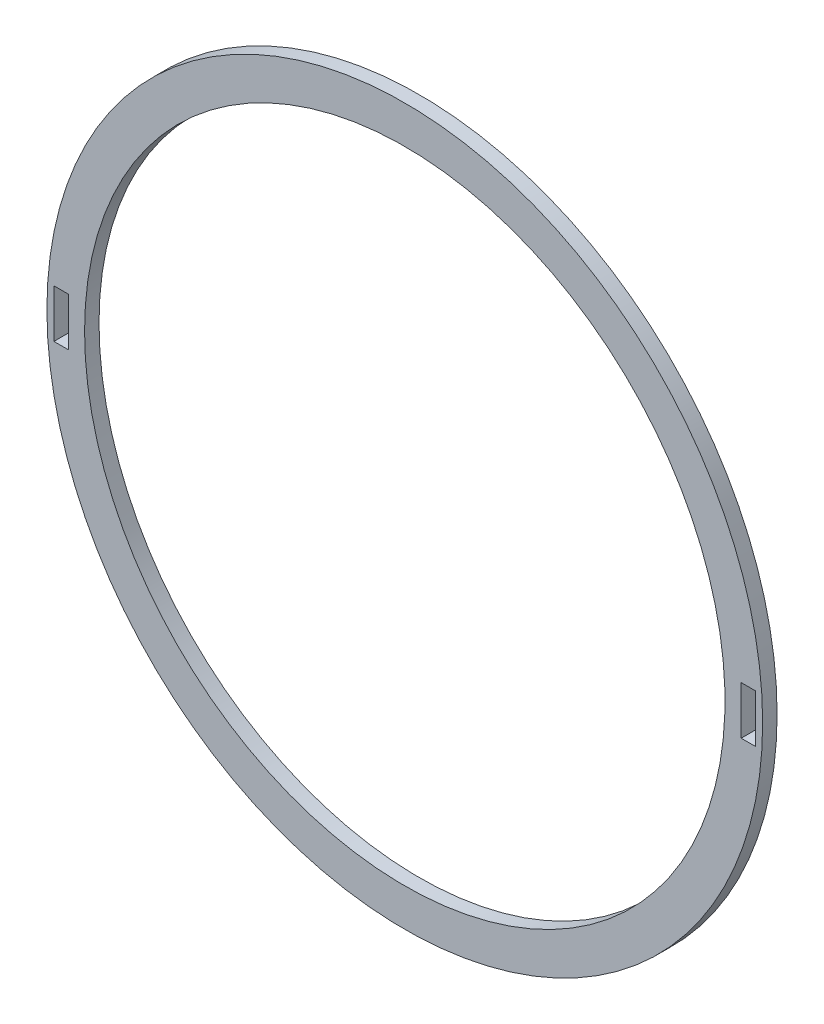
ISO-10303-21;
HEADER;
FILE_DESCRIPTION(('STEP AP214'),'2;1');
FILE_NAME('part.step','',(''),(''),'','','');
FILE_SCHEMA(('AUTOMOTIVE_DESIGN { 1 0 10303 214 1 1 1 1 }'));
ENDSEC;
DATA;
#1=APPLICATION_CONTEXT('core data for automotive mechanical design processes');
#2=APPLICATION_PROTOCOL_DEFINITION('international standard','automotive_design',2000,#1);
#3=PRODUCT_CONTEXT('',#1,'mechanical');
#4=PRODUCT('Part','Part','',(#3));
#5=PRODUCT_RELATED_PRODUCT_CATEGORY('part','',(#4));
#6=PRODUCT_DEFINITION_FORMATION('','',#4);
#7=PRODUCT_DEFINITION_CONTEXT('part definition',#1,'design');
#8=PRODUCT_DEFINITION('design','',#6,#7);
#9=PRODUCT_DEFINITION_SHAPE('','',#8);
#10=(LENGTH_UNIT() NAMED_UNIT(*) SI_UNIT(.MILLI.,.METRE.));
#11=(NAMED_UNIT(*) PLANE_ANGLE_UNIT() SI_UNIT($,.RADIAN.));
#12=(NAMED_UNIT(*) SI_UNIT($,.STERADIAN.) SOLID_ANGLE_UNIT());
#13=UNCERTAINTY_MEASURE_WITH_UNIT(LENGTH_MEASURE(1.E-05),#10,'distance_accuracy_value','');
#14=(GEOMETRIC_REPRESENTATION_CONTEXT(3) GLOBAL_UNCERTAINTY_ASSIGNED_CONTEXT((#13)) GLOBAL_UNIT_ASSIGNED_CONTEXT((#10,
#11,#12)) REPRESENTATION_CONTEXT('',''));
#15=CARTESIAN_POINT('',(0.,0.,0.));
#16=DIRECTION('',(0.,0.,1.));
#17=DIRECTION('',(1.,0.,0.));
#18=AXIS2_PLACEMENT_3D('',#15,#16,#17);
#19=CARTESIAN_POINT('',(0.,25.141193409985,1.524));
#20=DIRECTION('',(0.,0.,1.));
#21=DIRECTION('',(1.,0.,0.));
#22=AXIS2_PLACEMENT_3D('',#19,#20,#21);
#23=PLANE('',#22);
#24=CARTESIAN_POINT('',(0.,25.141193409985,1.524));
#25=DIRECTION('',(0.,0.,1.));
#26=DIRECTION('',(1.,0.,0.));
#27=AXIS2_PLACEMENT_3D('',#24,#25,#26);
#28=CIRCLE('',#27,33.7768673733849);
#29=CARTESIAN_POINT('',(-33.7768673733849,25.141193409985,1.524));
#30=VERTEX_POINT('',#29);
#31=EDGE_CURVE('E135',#30,#30,#28,.T.);
#32=ORIENTED_EDGE('',*,*,#31,.F.);
#33=EDGE_LOOP('',(#32));
#34=FACE_BOUND('',#33,.T.);
#35=CARTESIAN_POINT('',(0.,25.141193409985,1.524));
#36=DIRECTION('',(0.,0.,1.));
#37=DIRECTION('',(1.,0.,0.));
#38=AXIS2_PLACEMENT_3D('',#35,#36,#37);
#39=CIRCLE('',#38,37.7498927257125);
#40=CARTESIAN_POINT('',(-37.7498927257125,25.141193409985,1.524));
#41=VERTEX_POINT('',#40);
#42=EDGE_CURVE('E11',#41,#41,#39,.T.);
#43=ORIENTED_EDGE('',*,*,#42,.T.);
#44=EDGE_LOOP('',(#43));
#45=FACE_BOUND('',#44,.T.);
#46=DIRECTION('',(-1.,0.,0.));
#47=VECTOR('',#46,1.);
#48=CARTESIAN_POINT('',(37.0095439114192,27.681193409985,1.524));
#49=LINE('',#48,#47);
#50=CARTESIAN_POINT('',(37.0095439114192,27.681193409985,1.524));
#51=VERTEX_POINT('',#50);
#52=CARTESIAN_POINT('',(35.4855439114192,27.681193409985,1.524));
#53=VERTEX_POINT('',#52);
#54=EDGE_CURVE('E143',#51,#53,#49,.T.);
#55=ORIENTED_EDGE('',*,*,#54,.F.);
#56=DIRECTION('',(0.,1.,0.));
#57=VECTOR('',#56,1.);
#58=CARTESIAN_POINT('',(37.0095439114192,27.681193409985,1.524));
#59=LINE('',#58,#57);
#60=CARTESIAN_POINT('',(37.0095439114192,22.601193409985,1.524));
#61=VERTEX_POINT('',#60);
#62=EDGE_CURVE('E141',#61,#51,#59,.T.);
#63=ORIENTED_EDGE('',*,*,#62,.F.);
#64=DIRECTION('',(1.,0.,0.));
#65=VECTOR('',#64,1.);
#66=CARTESIAN_POINT('',(37.0095439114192,22.601193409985,1.524));
#67=LINE('',#66,#65);
#68=CARTESIAN_POINT('',(35.4855439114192,22.601193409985,1.524));
#69=VERTEX_POINT('',#68);
#70=EDGE_CURVE('E149',#69,#61,#67,.T.);
#71=ORIENTED_EDGE('',*,*,#70,.F.);
#72=DIRECTION('',(0.,-1.,0.));
#73=VECTOR('',#72,1.);
#74=CARTESIAN_POINT('',(35.4855439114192,27.681193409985,1.524));
#75=LINE('',#74,#73);
#76=EDGE_CURVE('E146',#53,#69,#75,.T.);
#77=ORIENTED_EDGE('',*,*,#76,.F.);
#78=EDGE_LOOP('',(#55,#63,#71,#77));
#79=FACE_BOUND('',#78,.T.);
#80=DIRECTION('',(0.,-1.,0.));
#81=VECTOR('',#80,1.);
#82=CARTESIAN_POINT('',(-37.0095439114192,27.681193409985,1.524));
#83=LINE('',#82,#81);
#84=CARTESIAN_POINT('',(-37.0095439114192,27.681193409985,1.524));
#85=VERTEX_POINT('',#84);
#86=CARTESIAN_POINT('',(-37.0095439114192,22.601193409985,1.524));
#87=VERTEX_POINT('',#86);
#88=EDGE_CURVE('E107',#85,#87,#83,.T.);
#89=ORIENTED_EDGE('',*,*,#88,.F.);
#90=DIRECTION('',(-1.,0.,0.));
#91=VECTOR('',#90,1.);
#92=CARTESIAN_POINT('',(-37.0095439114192,27.681193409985,1.524));
#93=LINE('',#92,#91);
#94=CARTESIAN_POINT('',(-35.4855439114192,27.681193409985,1.524));
#95=VERTEX_POINT('',#94);
#96=EDGE_CURVE('E99',#95,#85,#93,.T.);
#97=ORIENTED_EDGE('',*,*,#96,.F.);
#98=DIRECTION('',(0.,1.,0.));
#99=VECTOR('',#98,1.);
#100=CARTESIAN_POINT('',(-35.4855439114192,27.681193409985,1.524));
#101=LINE('',#100,#99);
#102=CARTESIAN_POINT('',(-35.4855439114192,22.601193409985,1.524));
#103=VERTEX_POINT('',#102);
#104=EDGE_CURVE('E121',#103,#95,#101,.T.);
#105=ORIENTED_EDGE('',*,*,#104,.F.);
#106=DIRECTION('',(1.,0.,0.));
#107=VECTOR('',#106,1.);
#108=CARTESIAN_POINT('',(-37.0095439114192,22.601193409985,1.524));
#109=LINE('',#108,#107);
#110=EDGE_CURVE('E119',#87,#103,#109,.T.);
#111=ORIENTED_EDGE('',*,*,#110,.F.);
#112=EDGE_LOOP('',(#89,#97,#105,#111));
#113=FACE_BOUND('',#112,.T.);
#114=ADVANCED_FACE('F34',(#34,#45,#79,#113),#23,.T.);
#115=CARTESIAN_POINT('',(0.,25.141193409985,0.));
#116=DIRECTION('',(0.,0.,1.));
#117=DIRECTION('',(1.,0.,0.));
#118=AXIS2_PLACEMENT_3D('',#115,#116,#117);
#119=PLANE('',#118);
#120=CARTESIAN_POINT('',(0.,25.141193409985,0.));
#121=DIRECTION('',(0.,0.,1.));
#122=DIRECTION('',(1.,0.,0.));
#123=AXIS2_PLACEMENT_3D('',#120,#121,#122);
#124=CIRCLE('',#123,33.7768673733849);
#125=CARTESIAN_POINT('',(-33.7768673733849,25.141193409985,0.));
#126=VERTEX_POINT('',#125);
#127=EDGE_CURVE('E115',#126,#126,#124,.T.);
#128=ORIENTED_EDGE('',*,*,#127,.T.);
#129=EDGE_LOOP('',(#128));
#130=FACE_BOUND('',#129,.T.);
#131=CARTESIAN_POINT('',(0.,25.141193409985,0.));
#132=DIRECTION('',(0.,0.,1.));
#133=DIRECTION('',(1.,0.,0.));
#134=AXIS2_PLACEMENT_3D('',#131,#132,#133);
#135=CIRCLE('',#134,37.7498927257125);
#136=CARTESIAN_POINT('',(-37.7498927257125,25.141193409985,0.));
#137=VERTEX_POINT('',#136);
#138=EDGE_CURVE('E38',#137,#137,#135,.T.);
#139=ORIENTED_EDGE('',*,*,#138,.F.);
#140=EDGE_LOOP('',(#139));
#141=FACE_BOUND('',#140,.T.);
#142=DIRECTION('',(0.,1.,0.));
#143=VECTOR('',#142,1.);
#144=CARTESIAN_POINT('',(37.0095439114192,27.681193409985,0.));
#145=LINE('',#144,#143);
#146=CARTESIAN_POINT('',(37.0095439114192,22.601193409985,0.));
#147=VERTEX_POINT('',#146);
#148=CARTESIAN_POINT('',(37.0095439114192,27.681193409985,0.));
#149=VERTEX_POINT('',#148);
#150=EDGE_CURVE('E138',#147,#149,#145,.T.);
#151=ORIENTED_EDGE('',*,*,#150,.T.);
#152=DIRECTION('',(-1.,0.,0.));
#153=VECTOR('',#152,1.);
#154=CARTESIAN_POINT('',(37.0095439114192,27.681193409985,0.));
#155=LINE('',#154,#153);
#156=CARTESIAN_POINT('',(35.4855439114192,27.681193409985,0.));
#157=VERTEX_POINT('',#156);
#158=EDGE_CURVE('E154',#149,#157,#155,.T.);
#159=ORIENTED_EDGE('',*,*,#158,.T.);
#160=DIRECTION('',(0.,-1.,0.));
#161=VECTOR('',#160,1.);
#162=CARTESIAN_POINT('',(35.4855439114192,27.681193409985,0.));
#163=LINE('',#162,#161);
#164=CARTESIAN_POINT('',(35.4855439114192,22.601193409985,0.));
#165=VERTEX_POINT('',#164);
#166=EDGE_CURVE('E157',#157,#165,#163,.T.);
#167=ORIENTED_EDGE('',*,*,#166,.T.);
#168=DIRECTION('',(1.,0.,0.));
#169=VECTOR('',#168,1.);
#170=CARTESIAN_POINT('',(37.0095439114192,22.601193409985,0.));
#171=LINE('',#170,#169);
#172=EDGE_CURVE('E144',#165,#147,#171,.T.);
#173=ORIENTED_EDGE('',*,*,#172,.T.);
#174=EDGE_LOOP('',(#151,#159,#167,#173));
#175=FACE_BOUND('',#174,.T.);
#176=DIRECTION('',(-1.,0.,0.));
#177=VECTOR('',#176,1.);
#178=CARTESIAN_POINT('',(-37.0095439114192,27.681193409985,0.));
#179=LINE('',#178,#177);
#180=CARTESIAN_POINT('',(-35.4855439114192,27.681193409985,0.));
#181=VERTEX_POINT('',#180);
#182=CARTESIAN_POINT('',(-37.0095439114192,27.681193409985,0.));
#183=VERTEX_POINT('',#182);
#184=EDGE_CURVE('E57',#181,#183,#179,.T.);
#185=ORIENTED_EDGE('',*,*,#184,.T.);
#186=DIRECTION('',(0.,-1.,0.));
#187=VECTOR('',#186,1.);
#188=CARTESIAN_POINT('',(-37.0095439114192,27.681193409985,0.));
#189=LINE('',#188,#187);
#190=CARTESIAN_POINT('',(-37.0095439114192,22.601193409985,0.));
#191=VERTEX_POINT('',#190);
#192=EDGE_CURVE('E114',#183,#191,#189,.T.);
#193=ORIENTED_EDGE('',*,*,#192,.T.);
#194=DIRECTION('',(1.,0.,0.));
#195=VECTOR('',#194,1.);
#196=CARTESIAN_POINT('',(-37.0095439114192,22.601193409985,0.));
#197=LINE('',#196,#195);
#198=CARTESIAN_POINT('',(-35.4855439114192,22.601193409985,0.));
#199=VERTEX_POINT('',#198);
#200=EDGE_CURVE('E127',#191,#199,#197,.T.);
#201=ORIENTED_EDGE('',*,*,#200,.T.);
#202=DIRECTION('',(0.,1.,0.));
#203=VECTOR('',#202,1.);
#204=CARTESIAN_POINT('',(-35.4855439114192,27.681193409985,0.));
#205=LINE('',#204,#203);
#206=EDGE_CURVE('E108',#199,#181,#205,.T.);
#207=ORIENTED_EDGE('',*,*,#206,.T.);
#208=EDGE_LOOP('',(#185,#193,#201,#207));
#209=FACE_BOUND('',#208,.T.);
#210=ADVANCED_FACE('F176',(#130,#141,#175,#209),#119,.F.);
#211=CARTESIAN_POINT('',(0.,25.141193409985,1.524));
#212=DIRECTION('',(0.,0.,-1.));
#213=DIRECTION('',(-1.,0.,0.));
#214=AXIS2_PLACEMENT_3D('',#211,#212,#213);
#215=CYLINDRICAL_SURFACE('',#214,37.7498927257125);
#216=CARTESIAN_POINT('',(-37.7498927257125,25.141193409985,1.524));
#217=CARTESIAN_POINT('',(-37.7498927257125,25.141193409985,1.508125));
#218=CARTESIAN_POINT('',(-37.7498927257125,25.141193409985,1.49225));
#219=CARTESIAN_POINT('',(-37.7498927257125,25.141193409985,1.4605));
#220=CARTESIAN_POINT('',(-37.7498927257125,25.141193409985,1.444625));
#221=CARTESIAN_POINT('',(-37.7498927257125,25.141193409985,1.412875));
#222=CARTESIAN_POINT('',(-37.7498927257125,25.141193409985,1.397));
#223=CARTESIAN_POINT('',(-37.7498927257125,25.141193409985,1.36525));
#224=CARTESIAN_POINT('',(-37.7498927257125,25.141193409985,1.349375));
#225=CARTESIAN_POINT('',(-37.7498927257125,25.141193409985,1.317625));
#226=CARTESIAN_POINT('',(-37.7498927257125,25.141193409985,1.30175));
#227=CARTESIAN_POINT('',(-37.7498927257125,25.141193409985,1.27));
#228=CARTESIAN_POINT('',(-37.7498927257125,25.141193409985,1.254125));
#229=CARTESIAN_POINT('',(-37.7498927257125,25.141193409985,1.222375));
#230=CARTESIAN_POINT('',(-37.7498927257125,25.141193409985,1.2065));
#231=CARTESIAN_POINT('',(-37.7498927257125,25.141193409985,1.17475));
#232=CARTESIAN_POINT('',(-37.7498927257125,25.141193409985,1.158875));
#233=CARTESIAN_POINT('',(-37.7498927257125,25.141193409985,1.127125));
#234=CARTESIAN_POINT('',(-37.7498927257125,25.141193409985,1.11125));
#235=CARTESIAN_POINT('',(-37.7498927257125,25.141193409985,1.0795));
#236=CARTESIAN_POINT('',(-37.7498927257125,25.141193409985,1.063625));
#237=CARTESIAN_POINT('',(-37.7498927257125,25.141193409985,1.031875));
#238=CARTESIAN_POINT('',(-37.7498927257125,25.141193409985,1.016));
#239=CARTESIAN_POINT('',(-37.7498927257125,25.141193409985,0.98425));
#240=CARTESIAN_POINT('',(-37.7498927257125,25.141193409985,0.968375));
#241=CARTESIAN_POINT('',(-37.7498927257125,25.141193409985,0.936625));
#242=CARTESIAN_POINT('',(-37.7498927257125,25.141193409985,0.92075));
#243=CARTESIAN_POINT('',(-37.7498927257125,25.141193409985,0.889));
#244=CARTESIAN_POINT('',(-37.7498927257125,25.141193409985,0.873125));
#245=CARTESIAN_POINT('',(-37.7498927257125,25.141193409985,0.841375));
#246=CARTESIAN_POINT('',(-37.7498927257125,25.141193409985,0.8255));
#247=CARTESIAN_POINT('',(-37.7498927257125,25.141193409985,0.79375));
#248=CARTESIAN_POINT('',(-37.7498927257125,25.141193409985,0.777875));
#249=CARTESIAN_POINT('',(-37.7498927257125,25.141193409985,0.746125));
#250=CARTESIAN_POINT('',(-37.7498927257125,25.141193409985,0.73025));
#251=CARTESIAN_POINT('',(-37.7498927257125,25.141193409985,0.6985));
#252=CARTESIAN_POINT('',(-37.7498927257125,25.141193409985,0.682625));
#253=CARTESIAN_POINT('',(-37.7498927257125,25.141193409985,0.650875));
#254=CARTESIAN_POINT('',(-37.7498927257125,25.141193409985,0.635));
#255=CARTESIAN_POINT('',(-37.7498927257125,25.141193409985,0.60325));
#256=CARTESIAN_POINT('',(-37.7498927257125,25.141193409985,0.587375));
#257=CARTESIAN_POINT('',(-37.7498927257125,25.141193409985,0.555625));
#258=CARTESIAN_POINT('',(-37.7498927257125,25.141193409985,0.53975));
#259=CARTESIAN_POINT('',(-37.7498927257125,25.141193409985,0.508));
#260=CARTESIAN_POINT('',(-37.7498927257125,25.141193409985,0.492125));
#261=CARTESIAN_POINT('',(-37.7498927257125,25.141193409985,0.460375));
#262=CARTESIAN_POINT('',(-37.7498927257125,25.141193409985,0.4445));
#263=CARTESIAN_POINT('',(-37.7498927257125,25.141193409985,0.41275));
#264=CARTESIAN_POINT('',(-37.7498927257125,25.141193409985,0.396875));
#265=CARTESIAN_POINT('',(-37.7498927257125,25.141193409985,0.365125));
#266=CARTESIAN_POINT('',(-37.7498927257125,25.141193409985,0.34925));
#267=CARTESIAN_POINT('',(-37.7498927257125,25.141193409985,0.3175));
#268=CARTESIAN_POINT('',(-37.7498927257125,25.141193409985,0.301625));
#269=CARTESIAN_POINT('',(-37.7498927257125,25.141193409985,0.269875));
#270=CARTESIAN_POINT('',(-37.7498927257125,25.141193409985,0.254));
#271=CARTESIAN_POINT('',(-37.7498927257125,25.141193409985,0.22225));
#272=CARTESIAN_POINT('',(-37.7498927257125,25.141193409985,0.206375));
#273=CARTESIAN_POINT('',(-37.7498927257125,25.141193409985,0.174625));
#274=CARTESIAN_POINT('',(-37.7498927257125,25.141193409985,0.15875));
#275=CARTESIAN_POINT('',(-37.7498927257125,25.141193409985,0.127));
#276=CARTESIAN_POINT('',(-37.7498927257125,25.141193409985,0.111125));
#277=CARTESIAN_POINT('',(-37.7498927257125,25.141193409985,0.079375));
#278=CARTESIAN_POINT('',(-37.7498927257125,25.141193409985,0.0635));
#279=CARTESIAN_POINT('',(-37.7498927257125,25.141193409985,0.0317499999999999));
#280=CARTESIAN_POINT('',(-37.7498927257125,25.141193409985,0.015875));
#281=CARTESIAN_POINT('',(-37.7498927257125,25.141193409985,0.));
#282=B_SPLINE_CURVE_WITH_KNOTS('',3,(#216,#217,#218,#219,#220,#221,#222,#223,#224,#225,#226,
#227,#228,#229,#230,#231,#232,#233,#234,#235,#236,#237,#238,#239,#240,#241,#242,#243,#244,#245,
#246,#247,#248,#249,#250,#251,#252,#253,#254,#255,#256,#257,#258,#259,#260,#261,#262,#263,#264,
#265,#266,#267,#268,#269,#270,#271,#272,#273,#274,#275,#276,#277,#278,#279,#280,#281),
.UNSPECIFIED.,.F.,.F.,(4,2,2,2,2,2,2,2,2,2,2,2,2,2,2,2,2,2,2,2,2,2,2,2,2,2,2,2,2,2,2,2,4),(0.,
0.0476249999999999,0.0952499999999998,0.142875,0.1905,0.238125,0.28575,0.333375,0.381,0.428625,
0.47625,0.523875,0.5715,0.619125,0.66675,0.714375,0.762,0.809625,0.85725,0.904875,0.9525,
1.000125,1.04775,1.095375,1.143,1.190625,1.23825,1.285875,1.3335,1.381125,1.42875,1.476375,
1.524),.UNSPECIFIED.);
#283=EDGE_CURVE('BSEAM36',#41,#137,#282,.T.);
#284=ORIENTED_EDGE('',*,*,#42,.F.);
#285=ORIENTED_EDGE('',*,*,#138,.T.);
#286=ORIENTED_EDGE('',*,*,#283,.T.);
#287=ORIENTED_EDGE('',*,*,#283,.F.);
#288=EDGE_LOOP('',(#284,#286,#285,#287));
#289=FACE_BOUND('',#288,.T.);
#290=ADVANCED_FACE('F36',(#289),#215,.T.);
#291=CARTESIAN_POINT('',(37.0095439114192,27.681193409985,1.524));
#292=DIRECTION('',(-1.,0.,0.));
#293=DIRECTION('',(0.,0.,1.));
#294=AXIS2_PLACEMENT_3D('',#291,#292,#293);
#295=PLANE('',#294);
#296=ORIENTED_EDGE('',*,*,#150,.F.);
#297=DIRECTION('',(0.,0.,-1.));
#298=VECTOR('',#297,1.);
#299=CARTESIAN_POINT('',(37.0095439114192,22.601193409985,1.524));
#300=LINE('',#299,#298);
#301=EDGE_CURVE('E151',#61,#147,#300,.T.);
#302=ORIENTED_EDGE('',*,*,#301,.F.);
#303=ORIENTED_EDGE('',*,*,#62,.T.);
#304=DIRECTION('',(0.,0.,-1.));
#305=VECTOR('',#304,1.);
#306=CARTESIAN_POINT('',(37.0095439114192,27.681193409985,1.524));
#307=LINE('',#306,#305);
#308=EDGE_CURVE('E168',#51,#149,#307,.T.);
#309=ORIENTED_EDGE('',*,*,#308,.T.);
#310=EDGE_LOOP('',(#296,#302,#303,#309));
#311=FACE_BOUND('',#310,.T.);
#312=ADVANCED_FACE('F199',(#311),#295,.T.);
#313=CARTESIAN_POINT('',(37.0095439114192,27.681193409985,1.524));
#314=DIRECTION('',(0.,-1.,0.));
#315=DIRECTION('',(0.,0.,-1.));
#316=AXIS2_PLACEMENT_3D('',#313,#314,#315);
#317=PLANE('',#316);
#318=ORIENTED_EDGE('',*,*,#158,.F.);
#319=ORIENTED_EDGE('',*,*,#308,.F.);
#320=ORIENTED_EDGE('',*,*,#54,.T.);
#321=DIRECTION('',(0.,0.,-1.));
#322=VECTOR('',#321,1.);
#323=CARTESIAN_POINT('',(35.4855439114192,27.681193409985,1.524));
#324=LINE('',#323,#322);
#325=EDGE_CURVE('E166',#53,#157,#324,.T.);
#326=ORIENTED_EDGE('',*,*,#325,.T.);
#327=EDGE_LOOP('',(#318,#319,#320,#326));
#328=FACE_BOUND('',#327,.T.);
#329=ADVANCED_FACE('F202',(#328),#317,.T.);
#330=CARTESIAN_POINT('',(35.4855439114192,27.681193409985,1.524));
#331=DIRECTION('',(1.,0.,0.));
#332=DIRECTION('',(0.,0.,-1.));
#333=AXIS2_PLACEMENT_3D('',#330,#331,#332);
#334=PLANE('',#333);
#335=ORIENTED_EDGE('',*,*,#166,.F.);
#336=ORIENTED_EDGE('',*,*,#325,.F.);
#337=ORIENTED_EDGE('',*,*,#76,.T.);
#338=DIRECTION('',(0.,0.,-1.));
#339=VECTOR('',#338,1.);
#340=CARTESIAN_POINT('',(35.4855439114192,22.601193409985,1.524));
#341=LINE('',#340,#339);
#342=EDGE_CURVE('E164',#69,#165,#341,.T.);
#343=ORIENTED_EDGE('',*,*,#342,.T.);
#344=EDGE_LOOP('',(#335,#336,#337,#343));
#345=FACE_BOUND('',#344,.T.);
#346=ADVANCED_FACE('F205',(#345),#334,.T.);
#347=CARTESIAN_POINT('',(37.0095439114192,22.601193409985,1.524));
#348=DIRECTION('',(0.,1.,0.));
#349=DIRECTION('',(0.,0.,1.));
#350=AXIS2_PLACEMENT_3D('',#347,#348,#349);
#351=PLANE('',#350);
#352=ORIENTED_EDGE('',*,*,#172,.F.);
#353=ORIENTED_EDGE('',*,*,#342,.F.);
#354=ORIENTED_EDGE('',*,*,#70,.T.);
#355=ORIENTED_EDGE('',*,*,#301,.T.);
#356=EDGE_LOOP('',(#352,#353,#354,#355));
#357=FACE_BOUND('',#356,.T.);
#358=ADVANCED_FACE('F209',(#357),#351,.T.);
#359=CARTESIAN_POINT('',(0.,25.141193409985,1.524));
#360=DIRECTION('',(0.,0.,-1.));
#361=DIRECTION('',(-1.,0.,0.));
#362=AXIS2_PLACEMENT_3D('',#359,#360,#361);
#363=CYLINDRICAL_SURFACE('',#362,33.7768673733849);
#364=CARTESIAN_POINT('',(-33.7768673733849,25.141193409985,1.524));
#365=CARTESIAN_POINT('',(-33.7768673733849,25.141193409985,1.508125));
#366=CARTESIAN_POINT('',(-33.7768673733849,25.141193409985,1.49225));
#367=CARTESIAN_POINT('',(-33.7768673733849,25.141193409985,1.4605));
#368=CARTESIAN_POINT('',(-33.7768673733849,25.141193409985,1.444625));
#369=CARTESIAN_POINT('',(-33.7768673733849,25.141193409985,1.412875));
#370=CARTESIAN_POINT('',(-33.7768673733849,25.141193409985,1.397));
#371=CARTESIAN_POINT('',(-33.7768673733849,25.141193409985,1.36525));
#372=CARTESIAN_POINT('',(-33.7768673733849,25.141193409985,1.349375));
#373=CARTESIAN_POINT('',(-33.7768673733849,25.141193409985,1.317625));
#374=CARTESIAN_POINT('',(-33.7768673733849,25.141193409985,1.30175));
#375=CARTESIAN_POINT('',(-33.7768673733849,25.141193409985,1.27));
#376=CARTESIAN_POINT('',(-33.7768673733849,25.141193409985,1.254125));
#377=CARTESIAN_POINT('',(-33.7768673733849,25.141193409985,1.222375));
#378=CARTESIAN_POINT('',(-33.7768673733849,25.141193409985,1.2065));
#379=CARTESIAN_POINT('',(-33.7768673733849,25.141193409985,1.17475));
#380=CARTESIAN_POINT('',(-33.7768673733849,25.141193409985,1.158875));
#381=CARTESIAN_POINT('',(-33.7768673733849,25.141193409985,1.127125));
#382=CARTESIAN_POINT('',(-33.7768673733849,25.141193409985,1.11125));
#383=CARTESIAN_POINT('',(-33.7768673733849,25.141193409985,1.0795));
#384=CARTESIAN_POINT('',(-33.7768673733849,25.141193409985,1.063625));
#385=CARTESIAN_POINT('',(-33.7768673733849,25.141193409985,1.031875));
#386=CARTESIAN_POINT('',(-33.7768673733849,25.141193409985,1.016));
#387=CARTESIAN_POINT('',(-33.7768673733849,25.141193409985,0.98425));
#388=CARTESIAN_POINT('',(-33.7768673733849,25.141193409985,0.968375));
#389=CARTESIAN_POINT('',(-33.7768673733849,25.141193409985,0.936625));
#390=CARTESIAN_POINT('',(-33.7768673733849,25.141193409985,0.92075));
#391=CARTESIAN_POINT('',(-33.7768673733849,25.141193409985,0.889));
#392=CARTESIAN_POINT('',(-33.7768673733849,25.141193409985,0.873125));
#393=CARTESIAN_POINT('',(-33.7768673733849,25.141193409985,0.841375));
#394=CARTESIAN_POINT('',(-33.7768673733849,25.141193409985,0.8255));
#395=CARTESIAN_POINT('',(-33.7768673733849,25.141193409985,0.79375));
#396=CARTESIAN_POINT('',(-33.7768673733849,25.141193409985,0.777875));
#397=CARTESIAN_POINT('',(-33.7768673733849,25.141193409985,0.746125));
#398=CARTESIAN_POINT('',(-33.7768673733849,25.141193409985,0.73025));
#399=CARTESIAN_POINT('',(-33.7768673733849,25.141193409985,0.6985));
#400=CARTESIAN_POINT('',(-33.7768673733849,25.141193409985,0.682625));
#401=CARTESIAN_POINT('',(-33.7768673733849,25.141193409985,0.650875));
#402=CARTESIAN_POINT('',(-33.7768673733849,25.141193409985,0.635));
#403=CARTESIAN_POINT('',(-33.7768673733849,25.141193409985,0.60325));
#404=CARTESIAN_POINT('',(-33.7768673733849,25.141193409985,0.587375));
#405=CARTESIAN_POINT('',(-33.7768673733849,25.141193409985,0.555625));
#406=CARTESIAN_POINT('',(-33.7768673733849,25.141193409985,0.53975));
#407=CARTESIAN_POINT('',(-33.7768673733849,25.141193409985,0.508));
#408=CARTESIAN_POINT('',(-33.7768673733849,25.141193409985,0.492125));
#409=CARTESIAN_POINT('',(-33.7768673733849,25.141193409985,0.460375));
#410=CARTESIAN_POINT('',(-33.7768673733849,25.141193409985,0.4445));
#411=CARTESIAN_POINT('',(-33.7768673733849,25.141193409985,0.41275));
#412=CARTESIAN_POINT('',(-33.7768673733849,25.141193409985,0.396875));
#413=CARTESIAN_POINT('',(-33.7768673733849,25.141193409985,0.365125));
#414=CARTESIAN_POINT('',(-33.7768673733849,25.141193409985,0.34925));
#415=CARTESIAN_POINT('',(-33.7768673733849,25.141193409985,0.3175));
#416=CARTESIAN_POINT('',(-33.7768673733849,25.141193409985,0.301625));
#417=CARTESIAN_POINT('',(-33.7768673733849,25.141193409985,0.269875));
#418=CARTESIAN_POINT('',(-33.7768673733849,25.141193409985,0.254));
#419=CARTESIAN_POINT('',(-33.7768673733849,25.141193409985,0.22225));
#420=CARTESIAN_POINT('',(-33.7768673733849,25.141193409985,0.206375));
#421=CARTESIAN_POINT('',(-33.7768673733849,25.141193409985,0.174625));
#422=CARTESIAN_POINT('',(-33.7768673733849,25.141193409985,0.15875));
#423=CARTESIAN_POINT('',(-33.7768673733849,25.141193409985,0.127));
#424=CARTESIAN_POINT('',(-33.7768673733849,25.141193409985,0.111125));
#425=CARTESIAN_POINT('',(-33.7768673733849,25.141193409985,0.079375));
#426=CARTESIAN_POINT('',(-33.7768673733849,25.141193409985,0.0635));
#427=CARTESIAN_POINT('',(-33.7768673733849,25.141193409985,0.0317499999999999));
#428=CARTESIAN_POINT('',(-33.7768673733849,25.141193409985,0.015875));
#429=CARTESIAN_POINT('',(-33.7768673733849,25.141193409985,0.));
#430=B_SPLINE_CURVE_WITH_KNOTS('',3,(#364,#365,#366,#367,#368,#369,#370,#371,#372,#373,#374,
#375,#376,#377,#378,#379,#380,#381,#382,#383,#384,#385,#386,#387,#388,#389,#390,#391,#392,#393,
#394,#395,#396,#397,#398,#399,#400,#401,#402,#403,#404,#405,#406,#407,#408,#409,#410,#411,#412,
#413,#414,#415,#416,#417,#418,#419,#420,#421,#422,#423,#424,#425,#426,#427,#428,#429),
.UNSPECIFIED.,.F.,.F.,(4,2,2,2,2,2,2,2,2,2,2,2,2,2,2,2,2,2,2,2,2,2,2,2,2,2,2,2,2,2,2,2,4),(0.,
0.0476250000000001,0.0952500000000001,0.142875,0.1905,0.238125,0.28575,0.333375,0.381,0.428625,
0.47625,0.523875,0.5715,0.619125,0.66675,0.714375,0.762,0.809625,0.85725,0.904875,0.9525,
1.000125,1.04775,1.095375,1.143,1.190625,1.23825,1.285875,1.3335,1.381125,1.42875,1.476375,
1.524),.UNSPECIFIED.);
#431=EDGE_CURVE('BSEAM213',#30,#126,#430,.T.);
#432=ORIENTED_EDGE('',*,*,#31,.T.);
#433=ORIENTED_EDGE('',*,*,#127,.F.);
#434=ORIENTED_EDGE('',*,*,#431,.T.);
#435=ORIENTED_EDGE('',*,*,#431,.F.);
#436=EDGE_LOOP('',(#432,#434,#433,#435));
#437=FACE_BOUND('',#436,.T.);
#438=ADVANCED_FACE('F213',(#437),#363,.F.);
#439=CARTESIAN_POINT('',(-37.0095439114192,27.681193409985,1.524));
#440=DIRECTION('',(0.,-1.,0.));
#441=DIRECTION('',(0.,0.,-1.));
#442=AXIS2_PLACEMENT_3D('',#439,#440,#441);
#443=PLANE('',#442);
#444=ORIENTED_EDGE('',*,*,#184,.F.);
#445=DIRECTION('',(0.,0.,-1.));
#446=VECTOR('',#445,1.);
#447=CARTESIAN_POINT('',(-35.4855439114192,27.681193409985,1.524));
#448=LINE('',#447,#446);
#449=EDGE_CURVE('E103',#95,#181,#448,.T.);
#450=ORIENTED_EDGE('',*,*,#449,.F.);
#451=ORIENTED_EDGE('',*,*,#96,.T.);
#452=DIRECTION('',(0.,0.,-1.));
#453=VECTOR('',#452,1.);
#454=CARTESIAN_POINT('',(-37.0095439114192,27.681193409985,1.524));
#455=LINE('',#454,#453);
#456=EDGE_CURVE('E102',#85,#183,#455,.T.);
#457=ORIENTED_EDGE('',*,*,#456,.T.);
#458=EDGE_LOOP('',(#444,#450,#451,#457));
#459=FACE_BOUND('',#458,.T.);
#460=ADVANCED_FACE('F101',(#459),#443,.T.);
#461=CARTESIAN_POINT('',(-37.0095439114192,27.681193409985,1.524));
#462=DIRECTION('',(1.,0.,0.));
#463=DIRECTION('',(0.,0.,-1.));
#464=AXIS2_PLACEMENT_3D('',#461,#462,#463);
#465=PLANE('',#464);
#466=ORIENTED_EDGE('',*,*,#192,.F.);
#467=ORIENTED_EDGE('',*,*,#456,.F.);
#468=ORIENTED_EDGE('',*,*,#88,.T.);
#469=DIRECTION('',(0.,0.,-1.));
#470=VECTOR('',#469,1.);
#471=CARTESIAN_POINT('',(-37.0095439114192,22.601193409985,1.524));
#472=LINE('',#471,#470);
#473=EDGE_CURVE('E116',#87,#191,#472,.T.);
#474=ORIENTED_EDGE('',*,*,#473,.T.);
#475=EDGE_LOOP('',(#466,#467,#468,#474));
#476=FACE_BOUND('',#475,.T.);
#477=ADVANCED_FACE('F111',(#476),#465,.T.);
#478=CARTESIAN_POINT('',(-37.0095439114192,22.601193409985,1.524));
#479=DIRECTION('',(0.,1.,0.));
#480=DIRECTION('',(0.,0.,1.));
#481=AXIS2_PLACEMENT_3D('',#478,#479,#480);
#482=PLANE('',#481);
#483=ORIENTED_EDGE('',*,*,#200,.F.);
#484=ORIENTED_EDGE('',*,*,#473,.F.);
#485=ORIENTED_EDGE('',*,*,#110,.T.);
#486=DIRECTION('',(0.,0.,-1.));
#487=VECTOR('',#486,1.);
#488=CARTESIAN_POINT('',(-35.4855439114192,22.601193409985,1.524));
#489=LINE('',#488,#487);
#490=EDGE_CURVE('E49',#103,#199,#489,.T.);
#491=ORIENTED_EDGE('',*,*,#490,.T.);
#492=EDGE_LOOP('',(#483,#484,#485,#491));
#493=FACE_BOUND('',#492,.T.);
#494=ADVANCED_FACE('F184',(#493),#482,.T.);
#495=CARTESIAN_POINT('',(-35.4855439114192,27.681193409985,1.524));
#496=DIRECTION('',(-1.,0.,0.));
#497=DIRECTION('',(0.,0.,1.));
#498=AXIS2_PLACEMENT_3D('',#495,#496,#497);
#499=PLANE('',#498);
#500=ORIENTED_EDGE('',*,*,#206,.F.);
#501=ORIENTED_EDGE('',*,*,#490,.F.);
#502=ORIENTED_EDGE('',*,*,#104,.T.);
#503=ORIENTED_EDGE('',*,*,#449,.T.);
#504=EDGE_LOOP('',(#500,#501,#502,#503));
#505=FACE_BOUND('',#504,.T.);
#506=ADVANCED_FACE('F182',(#505),#499,.T.);
#507=CLOSED_SHELL('',(#114,#210,#290,#312,#329,#346,#358,#438,#460,#477,#494,#506));
#508=MANIFOLD_SOLID_BREP('B2',#507);
#509=ADVANCED_BREP_SHAPE_REPRESENTATION('',(#18,#508),#14);
#510=SHAPE_DEFINITION_REPRESENTATION(#9,#509);
ENDSEC;
END-ISO-10303-21;
